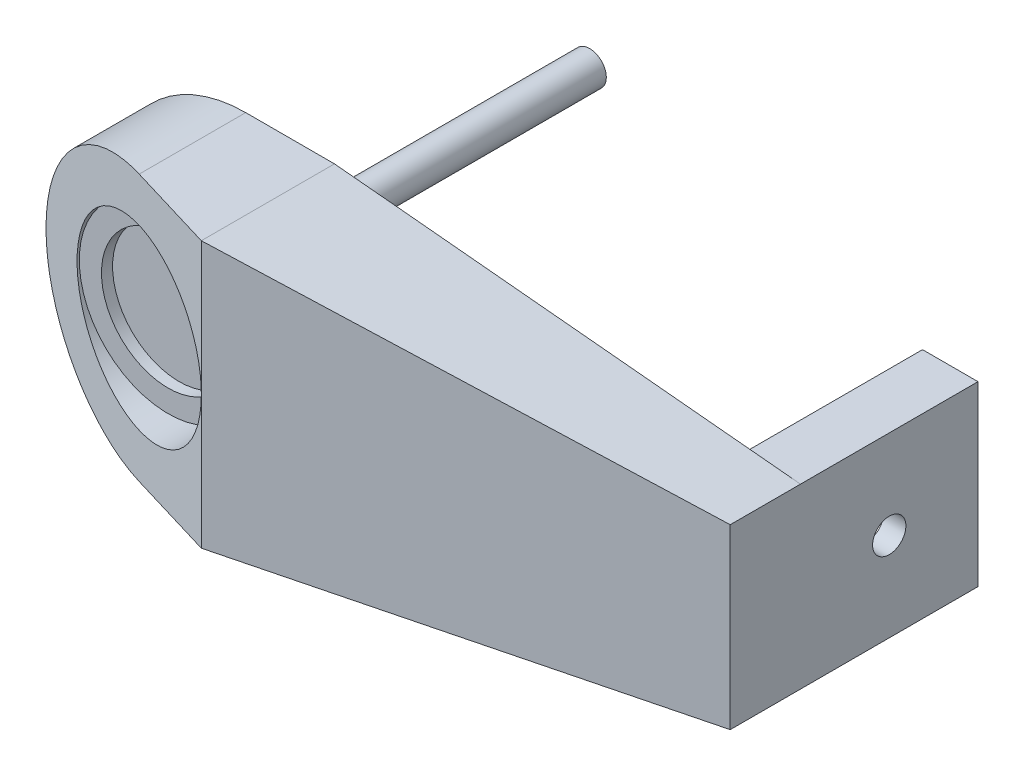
from build123d import *

# Parameters (mm, degrees)
BOSS_EXTRUDE1_DEPTH      = 60
BOSS_EXTRUDE1_DEPTH_BACK = 60
SKETCH1_W                = 2000
SKETCH1_H                = 240
CUT_EXTRUDE1_DEPTH       = 125
CUT_EXTRUDE1_DEPTH_BACK  = 203
SKETCH3_R                = 80
CUT_EXTRUDE2_DEPTH       = 332
CUT_EXTRUDE3_DEPTH       = 274
CUT_EXTRUDE3_DEPTH_BACK  = 321
SKETCH5_R                = 80
SKETCH5_R_2              = 60
BOSS_EXTRUDE2_DEPTH      = 10
SKETCH6_R                = 15
BOSS_EXTRUDE3_DEPTH      = 530
SKETCH7_R                = 15
CUT_EXTRUDE4_DEPTH       = 530
CUT_EXTRUDE5_DEPTH       = 66
CUT_EXTRUDE5_DEPTH_BACK  = 193
SKETCH9_W                = 283.673506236
SKETCH9_H                = 374.258323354
CUT_EXTRUDE6_DEPTH       = 177
CUT_EXTRUDE6_DEPTH_BACK  = 344
SKETCH10_W               = 1477.962805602
SKETCH10_H               = 445.772652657
BOSS_EXTRUDE4_DEPTH      = 80
BOSS_EXTRUDE4_DEPTH_BACK = 80
SKETCH11_W               = 50
SKETCH11_H               = 160
SKETCH12_W               = 30
SKETCH12_H               = 70
SKETCH13_R               = 15
CUT_EXTRUDE7_DEPTH       = 523
CUT_EXTRUDE8_DEPTH       = 273
CUT_EXTRUDE8_DEPTH_BACK  = 333
CUT_EXTRUDE10_DEPTH      = 154
CUT_EXTRUDE10_DEPTH_BACK = 236


with BuildPart() as part:
    # Sketch1 → Boss-Extrude1 (new, two sides: drawn at the far end of the back side and taken through both)
    with BuildSketch(Plane.XY.offset(-BOSS_EXTRUDE1_DEPTH_BACK)):
        Rectangle(SKETCH1_W, SKETCH1_H)
    extrude(amount=BOSS_EXTRUDE1_DEPTH + BOSS_EXTRUDE1_DEPTH_BACK)

    # Sketch2 → Cut-Extrude1 (cut, two sides: drawn at the far end of the back side and taken through both)
    with BuildSketch(Plane.XY.offset(-CUT_EXTRUDE1_DEPTH_BACK)):
        with BuildLine():
            Line((-880, 120), (-1006.825608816, 281.646305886))
            Line((-1006.825608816, 281.646305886), (-1134.79266536, 120))
            Line((-1134.79266536, 120), (-1063.819339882, -191.509197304))
            Line((-1063.819339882, -191.509197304), (-862.728251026, -191.509197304))
            Line((-862.728251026, -191.509197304), (-880, -120))
            ThreePointArc((-880, -120), (-1000, 0), (-880, 120))
        make_face()
        with BuildLine():
            Line((880, 120), (893.27601501, 184.167147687))
            Line((893.27601501, 184.167147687), (1104.453001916, 184.167147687))
            Line((1104.453001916, 184.167147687), (1104.453001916, -100.878332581))
            Line((1104.453001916, -100.878332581), (1008.858481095, -155.754598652))
            Line((1008.858481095, -155.754598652), (880, -120))
            ThreePointArc((880, -120), (1000, 0), (880, 120))
        make_face()
    extrude(amount=CUT_EXTRUDE1_DEPTH + CUT_EXTRUDE1_DEPTH_BACK, mode=Mode.SUBTRACT)

    # Sketch3 → Cut-Extrude2 (cut)
    with BuildSketch(Plane.XY):
        with Locations(Location((-880, 0, 0), (0, 0, 180))):
            Circle(SKETCH3_R)
        with Locations(Location((880, 0, 0), (0, 0, 180))):
            Circle(SKETCH3_R)
    extrude(amount=CUT_EXTRUDE2_DEPTH, mode=Mode.SUBTRACT)

    # Sketch4 → Cut-Extrude3 (cut, two sides: drawn at the far end of the back side and taken through both)
    with BuildSketch(Plane(origin=(0, 0, 0), x_dir=(1, 0, 0), z_dir=(0, 1, 0)).offset(-CUT_EXTRUDE3_DEPTH_BACK)):
        Polygon((-800, -60), (-1000, 0), (-1030.608079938, -49.976511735), (-1007.288101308, -94.135620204), (-816.758914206, -82.723715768), align=None)
        Polygon((800, -60), (1000, 0), (1023.971167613, -45.392211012), (975.065808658, -111.70387433), (805.564412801, -78.548042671), align=None)
    extrude(amount=CUT_EXTRUDE3_DEPTH + CUT_EXTRUDE3_DEPTH_BACK, mode=Mode.SUBTRACT)

    # Sketch5 → Boss-Extrude2 (add)
    with BuildSketch(Plane.XY):
        with Locations((-880, 0)):
            Circle(SKETCH5_R)
        with Locations((-880, 0)):
            Circle(SKETCH5_R_2, mode=Mode.SUBTRACT)
    extrude(amount=BOSS_EXTRUDE2_DEPTH)

    # Sketch6 → Boss-Extrude3 (add)
    with BuildSketch(Plane.XY):
        with Locations((-880, 0)):
            Circle(SKETCH6_R)
    extrude(amount=-BOSS_EXTRUDE3_DEPTH)

    # Sketch7 → Cut-Extrude4 (cut)
    with BuildSketch(Plane.XY):
        with Locations((880, 0)):
            Circle(SKETCH7_R)
    extrude(amount=-CUT_EXTRUDE4_DEPTH, mode=Mode.SUBTRACT)

    # Sketch9 → Cut-Extrude5 (cut, two sides: drawn at the far end of the back side and taken through both)
    with BuildSketch(Plane(origin=(0, 0, 0), x_dir=(1, 0, 0), z_dir=(0, 1, 0)).offset(-CUT_EXTRUDE5_DEPTH_BACK)):
        with Locations((-879.626250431, 557.129161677)):
            Rectangle(SKETCH9_W, SKETCH9_H)
    extrude(amount=CUT_EXTRUDE5_DEPTH + CUT_EXTRUDE5_DEPTH_BACK, mode=Mode.SUBTRACT)

    # Sketch10 → Cut-Extrude6 (cut, two sides: drawn at the far end of the back side and taken through both)
    with BuildSketch(Plane(origin=(0, 0, 0), x_dir=(1, 0, 0), z_dir=(0, 1, 0)).offset(-CUT_EXTRUDE6_DEPTH_BACK)):
        with Locations((358.981402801, 33.425640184)):
            Rectangle(SKETCH10_W, SKETCH10_H)
    extrude(amount=CUT_EXTRUDE6_DEPTH + CUT_EXTRUDE6_DEPTH_BACK, mode=Mode.SUBTRACT)

    # Sketch11 → Boss-Extrude4 (add, two sides: drawn at the far end of the back side and taken through both)
    with BuildSketch(Plane(origin=(0, 0, 0), x_dir=(1, 0, 0), z_dir=(0, 1, 0)).offset(-BOSS_EXTRUDE4_DEPTH_BACK)):
        with Locations((-405, 140)):
            Rectangle(SKETCH11_W, SKETCH11_H)
    extrude(amount=BOSS_EXTRUDE4_DEPTH + BOSS_EXTRUDE4_DEPTH_BACK)

    # Sketch12 → Cut-Revolve1 (revolve, cut)
    with BuildSketch(Plane(origin=(0, 0, 0), x_dir=(1, 0, 0), z_dir=(0, 1, 0)), mode=Mode.PRIVATE) as cut_revolve1_sk:
        with Locations((-415, 175)):
            Rectangle(SKETCH12_W, SKETCH12_H)
    revolve(cut_revolve1_sk.sketch.rotate(Axis((-462.366254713, 0, -140), (1, 0, 0)), 180), axis=Axis((-462.366254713, 0, -140), (1, 0, 0)), mode=Mode.SUBTRACT)

    # Sketch13 → Cut-Extrude7 (cut)
    with BuildSketch(Plane(origin=(0, 0, 0), x_dir=(0, 0, -1), z_dir=(1, 0, 0))):
        with Locations(Location((140, 0, 0), (0, 0, 180))):
            Circle(SKETCH13_R)
    extrude(amount=-CUT_EXTRUDE7_DEPTH, mode=Mode.SUBTRACT)

    # Sketch14 → Cut-Extrude8 (cut, two sides: drawn at the far end of the back side and taken through both)
    with BuildSketch(Plane.XY.offset(-CUT_EXTRUDE8_DEPTH_BACK)):
        Polygon((-380, 80), (-800, 120), (-807.128552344, 157.033548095), (-367.434617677, 150.38271547), (-367.434617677, 92.003184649), align=None)
        Polygon((-380, -80), (-800, -120), (-800, -140.036975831), (-330.485547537, -179.202990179), (-330.485547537, -124.518366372), align=None)
    extrude(amount=CUT_EXTRUDE8_DEPTH + CUT_EXTRUDE8_DEPTH_BACK, mode=Mode.SUBTRACT)

    # Sketch15 → Cut-Extrude10 (cut, two sides: drawn at the far end of the back side and taken through both)
    with BuildSketch(Plane(origin=(0, 0, 0), x_dir=(1, 0, 0), z_dir=(0, 1, 0)).offset(-CUT_EXTRUDE10_DEPTH_BACK)):
        Polygon((-800, -60), (-315.165645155, 5.443777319), (-330.260665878, -68.442376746), (-524.906985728, -140.739581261), align=None)
    extrude(amount=CUT_EXTRUDE10_DEPTH + CUT_EXTRUDE10_DEPTH_BACK, mode=Mode.SUBTRACT)


solid = part.part
